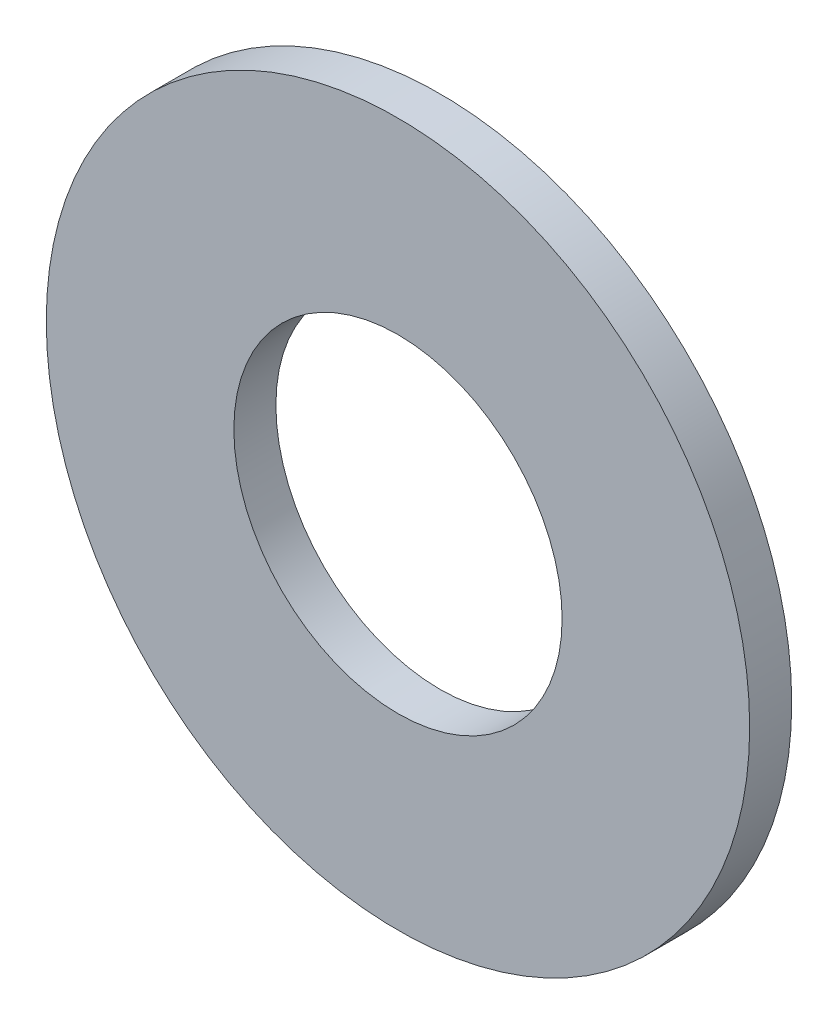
ISO-10303-21;
HEADER;
FILE_DESCRIPTION(('STEP AP214'),'2;1');
FILE_NAME('part.step','',(''),(''),'','','');
FILE_SCHEMA(('AUTOMOTIVE_DESIGN { 1 0 10303 214 1 1 1 1 }'));
ENDSEC;
DATA;
#1=APPLICATION_CONTEXT('core data for automotive mechanical design processes');
#2=APPLICATION_PROTOCOL_DEFINITION('international standard','automotive_design',2000,#1);
#3=PRODUCT_CONTEXT('',#1,'mechanical');
#4=PRODUCT('Part','Part','',(#3));
#5=PRODUCT_RELATED_PRODUCT_CATEGORY('part','',(#4));
#6=PRODUCT_DEFINITION_FORMATION('','',#4);
#7=PRODUCT_DEFINITION_CONTEXT('part definition',#1,'design');
#8=PRODUCT_DEFINITION('design','',#6,#7);
#9=PRODUCT_DEFINITION_SHAPE('','',#8);
#10=(LENGTH_UNIT() NAMED_UNIT(*) SI_UNIT(.MILLI.,.METRE.));
#11=(NAMED_UNIT(*) PLANE_ANGLE_UNIT() SI_UNIT($,.RADIAN.));
#12=(NAMED_UNIT(*) SI_UNIT($,.STERADIAN.) SOLID_ANGLE_UNIT());
#13=UNCERTAINTY_MEASURE_WITH_UNIT(LENGTH_MEASURE(1.E-05),#10,'distance_accuracy_value','');
#14=(GEOMETRIC_REPRESENTATION_CONTEXT(3) GLOBAL_UNCERTAINTY_ASSIGNED_CONTEXT((#13)) GLOBAL_UNIT_ASSIGNED_CONTEXT((#10,
#11,#12)) REPRESENTATION_CONTEXT('',''));
#15=CARTESIAN_POINT('',(0.,0.,0.));
#16=DIRECTION('',(0.,0.,1.));
#17=DIRECTION('',(1.,0.,0.));
#18=AXIS2_PLACEMENT_3D('',#15,#16,#17);
#19=CARTESIAN_POINT('',(0.,0.,1.32080000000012));
#20=DIRECTION('',(0.,0.,1.));
#21=DIRECTION('',(1.,0.,0.));
#22=AXIS2_PLACEMENT_3D('',#19,#20,#21);
#23=PLANE('',#22);
#24=CARTESIAN_POINT('',(0.,0.,1.32080000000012));
#25=DIRECTION('',(0.,0.,1.));
#26=DIRECTION('',(1.,0.,0.));
#27=AXIS2_PLACEMENT_3D('',#24,#25,#26);
#28=CIRCLE('',#27,11.049);
#29=CARTESIAN_POINT('',(11.049,0.,1.32080000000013));
#30=VERTEX_POINT('',#29);
#31=EDGE_CURVE('E10',#30,#30,#28,.T.);
#32=ORIENTED_EDGE('',*,*,#31,.T.);
#33=EDGE_LOOP('',(#32));
#34=FACE_BOUND('',#33,.T.);
#35=CARTESIAN_POINT('',(0.,0.,1.32080000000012));
#36=DIRECTION('',(0.,0.,1.));
#37=DIRECTION('',(1.,0.,0.));
#38=AXIS2_PLACEMENT_3D('',#35,#36,#37);
#39=CIRCLE('',#38,5.1562);
#40=CARTESIAN_POINT('',(5.15620000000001,0.,1.32080000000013));
#41=VERTEX_POINT('',#40);
#42=EDGE_CURVE('E39',#41,#41,#39,.T.);
#43=ORIENTED_EDGE('',*,*,#42,.F.);
#44=EDGE_LOOP('',(#43));
#45=FACE_BOUND('',#44,.T.);
#46=ADVANCED_FACE('F28',(#34,#45),#23,.T.);
#47=CARTESIAN_POINT('',(0.,0.,1.11022302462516E-13));
#48=DIRECTION('',(0.,0.,1.));
#49=DIRECTION('',(1.,0.,0.));
#50=AXIS2_PLACEMENT_3D('',#47,#48,#49);
#51=PLANE('',#50);
#52=CARTESIAN_POINT('',(0.,0.,1.11022302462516E-13));
#53=DIRECTION('',(0.,0.,1.));
#54=DIRECTION('',(1.,0.,0.));
#55=AXIS2_PLACEMENT_3D('',#52,#53,#54);
#56=CIRCLE('',#55,11.049);
#57=CARTESIAN_POINT('',(11.049,0.,1.23251155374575E-13));
#58=VERTEX_POINT('',#57);
#59=EDGE_CURVE('E35',#58,#58,#56,.T.);
#60=ORIENTED_EDGE('',*,*,#59,.F.);
#61=EDGE_LOOP('',(#60));
#62=FACE_BOUND('',#61,.T.);
#63=CARTESIAN_POINT('',(0.,0.,1.11022302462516E-13));
#64=DIRECTION('',(0.,0.,1.));
#65=DIRECTION('',(1.,0.,0.));
#66=AXIS2_PLACEMENT_3D('',#63,#64,#65);
#67=CIRCLE('',#66,5.1562);
#68=CARTESIAN_POINT('',(5.1562,0.,1.16729100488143E-13));
#69=VERTEX_POINT('',#68);
#70=EDGE_CURVE('E43',#69,#69,#67,.T.);
#71=ORIENTED_EDGE('',*,*,#70,.T.);
#72=EDGE_LOOP('',(#71));
#73=FACE_BOUND('',#72,.T.);
#74=ADVANCED_FACE('F49',(#62,#73),#51,.F.);
#75=CARTESIAN_POINT('',(0.,0.,1.32080000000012));
#76=DIRECTION('',(0.,0.,-1.));
#77=DIRECTION('',(-1.,0.,0.));
#78=AXIS2_PLACEMENT_3D('',#75,#76,#77);
#79=CYLINDRICAL_SURFACE('',#78,11.049);
#80=ORIENTED_EDGE('',*,*,#31,.F.);
#81=EDGE_LOOP('',(#80));
#82=FACE_BOUND('',#81,.T.);
#83=ORIENTED_EDGE('',*,*,#59,.T.);
#84=EDGE_LOOP('',(#83));
#85=FACE_BOUND('',#84,.T.);
#86=ADVANCED_FACE('F30',(#82,#85),#79,.T.);
#87=CARTESIAN_POINT('',(0.,0.,1.32080000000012));
#88=DIRECTION('',(0.,0.,-1.));
#89=DIRECTION('',(-1.,0.,0.));
#90=AXIS2_PLACEMENT_3D('',#87,#88,#89);
#91=CYLINDRICAL_SURFACE('',#90,5.1562);
#92=ORIENTED_EDGE('',*,*,#42,.T.);
#93=EDGE_LOOP('',(#92));
#94=FACE_BOUND('',#93,.T.);
#95=ORIENTED_EDGE('',*,*,#70,.F.);
#96=EDGE_LOOP('',(#95));
#97=FACE_BOUND('',#96,.T.);
#98=ADVANCED_FACE('F51',(#94,#97),#91,.F.);
#99=CLOSED_SHELL('',(#46,#74,#86,#98));
#100=MANIFOLD_SOLID_BREP('B2',#99);
#101=ADVANCED_BREP_SHAPE_REPRESENTATION('',(#18,#100),#14);
#102=SHAPE_DEFINITION_REPRESENTATION(#9,#101);
ENDSEC;
END-ISO-10303-21;
